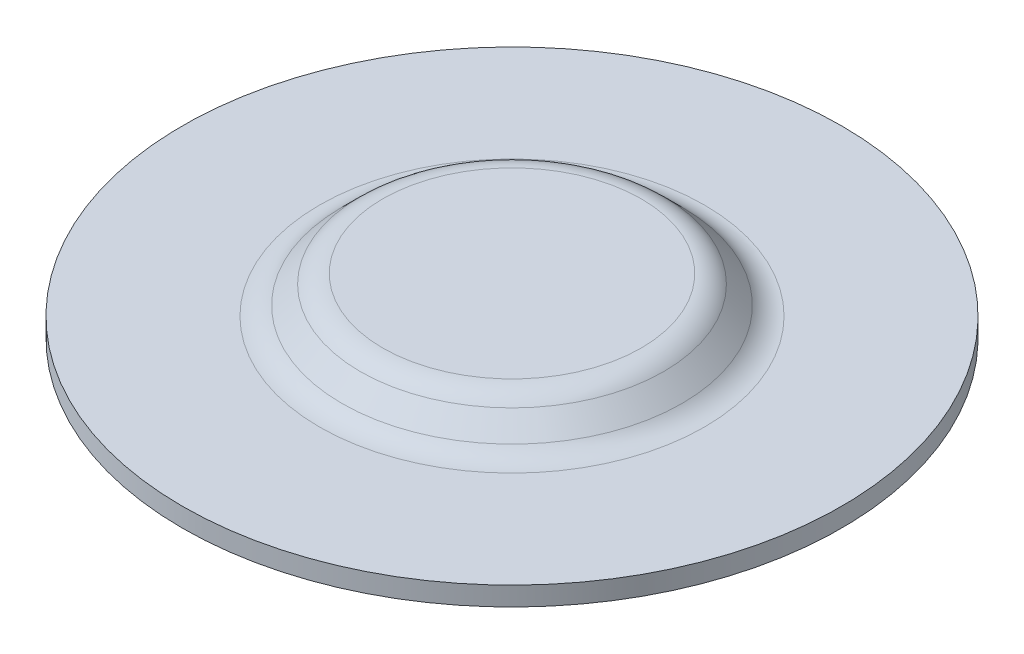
ISO-10303-21;
HEADER;
FILE_DESCRIPTION(('STEP AP214'),'2;1');
FILE_NAME('part.step','',(''),(''),'','','');
FILE_SCHEMA(('AUTOMOTIVE_DESIGN { 1 0 10303 214 1 1 1 1 }'));
ENDSEC;
DATA;
#1=APPLICATION_CONTEXT('core data for automotive mechanical design processes');
#2=APPLICATION_PROTOCOL_DEFINITION('international standard','automotive_design',2000,#1);
#3=PRODUCT_CONTEXT('',#1,'mechanical');
#4=PRODUCT('Part','Part','',(#3));
#5=PRODUCT_RELATED_PRODUCT_CATEGORY('part','',(#4));
#6=PRODUCT_DEFINITION_FORMATION('','',#4);
#7=PRODUCT_DEFINITION_CONTEXT('part definition',#1,'design');
#8=PRODUCT_DEFINITION('design','',#6,#7);
#9=PRODUCT_DEFINITION_SHAPE('','',#8);
#10=(LENGTH_UNIT() NAMED_UNIT(*) SI_UNIT(.MILLI.,.METRE.));
#11=(NAMED_UNIT(*) PLANE_ANGLE_UNIT() SI_UNIT($,.RADIAN.));
#12=(NAMED_UNIT(*) SI_UNIT($,.STERADIAN.) SOLID_ANGLE_UNIT());
#13=UNCERTAINTY_MEASURE_WITH_UNIT(LENGTH_MEASURE(1.E-05),#10,'distance_accuracy_value','');
#14=(GEOMETRIC_REPRESENTATION_CONTEXT(3) GLOBAL_UNCERTAINTY_ASSIGNED_CONTEXT((#13)) GLOBAL_UNIT_ASSIGNED_CONTEXT((#10,
#11,#12)) REPRESENTATION_CONTEXT('',''));
#15=CARTESIAN_POINT('',(0.,0.,0.));
#16=DIRECTION('',(0.,0.,1.));
#17=DIRECTION('',(1.,0.,0.));
#18=AXIS2_PLACEMENT_3D('',#15,#16,#17);
#19=CARTESIAN_POINT('',(0.,0.,0.));
#20=DIRECTION('',(0.,-1.,0.));
#21=DIRECTION('',(0.,0.,-1.));
#22=AXIS2_PLACEMENT_3D('',#19,#20,#21);
#23=PLANE('',#22);
#24=CARTESIAN_POINT('',(0.,0.,0.));
#25=DIRECTION('',(0.,-1.,0.));
#26=DIRECTION('',(0.,0.,1.));
#27=AXIS2_PLACEMENT_3D('',#24,#25,#26);
#28=CIRCLE('',#27,6.2267385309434);
#29=CARTESIAN_POINT('',(0.,0.,6.2267385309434));
#30=VERTEX_POINT('',#29);
#31=CARTESIAN_POINT('',(0.,0.,-6.2267385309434));
#32=VERTEX_POINT('',#31);
#33=EDGE_CURVE('E55',#30,#32,#28,.T.);
#34=ORIENTED_EDGE('',*,*,#33,.F.);
#35=CARTESIAN_POINT('',(0.,0.,0.));
#36=DIRECTION('',(0.,-1.,0.));
#37=DIRECTION('',(0.,0.,-1.));
#38=AXIS2_PLACEMENT_3D('',#35,#36,#37);
#39=CIRCLE('',#38,6.2267385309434);
#40=EDGE_CURVE('E57',#32,#30,#39,.T.);
#41=ORIENTED_EDGE('',*,*,#40,.F.);
#42=EDGE_LOOP('',(#34,#41));
#43=FACE_BOUND('',#42,.T.);
#44=ADVANCED_FACE('F18',(#43),#23,.F.);
#45=CARTESIAN_POINT('',(0.,-1.524,0.));
#46=DIRECTION('',(0.,1.,0.));
#47=DIRECTION('',(0.,0.,1.));
#48=AXIS2_PLACEMENT_3D('',#45,#46,#47);
#49=TOROIDAL_SURFACE('',#48,6.2267385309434,1.524);
#50=ORIENTED_EDGE('',*,*,#33,.T.);
#51=ORIENTED_EDGE('',*,*,#40,.T.);
#52=EDGE_LOOP('',(#50,#51));
#53=FACE_BOUND('',#52,.T.);
#54=CARTESIAN_POINT('',(0.,-0.446369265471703,0.));
#55=DIRECTION('',(0.,-1.,0.));
#56=DIRECTION('',(0.,0.,-1.));
#57=AXIS2_PLACEMENT_3D('',#54,#55,#56);
#58=CIRCLE('',#57,7.3043692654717);
#59=CARTESIAN_POINT('',(0.,-0.446369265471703,-7.3043692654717));
#60=VERTEX_POINT('',#59);
#61=EDGE_CURVE('E63',#60,#60,#58,.T.);
#62=ORIENTED_EDGE('',*,*,#61,.F.);
#63=EDGE_LOOP('',(#62));
#64=FACE_BOUND('',#63,.T.);
#65=ADVANCED_FACE('F59',(#53,#64),#49,.T.);
#66=CARTESIAN_POINT('',(0.,-1.3316307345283,0.));
#67=DIRECTION('',(0.,-1.,0.));
#68=DIRECTION('',(0.,0.,-1.));
#69=AXIS2_PLACEMENT_3D('',#66,#67,#68);
#70=CONICAL_SURFACE('',#69,8.18963073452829,0.785398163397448);
#71=CARTESIAN_POINT('',(0.,-1.3316307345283,0.));
#72=DIRECTION('',(0.,1.,0.));
#73=DIRECTION('',(0.,0.,1.));
#74=AXIS2_PLACEMENT_3D('',#71,#72,#73);
#75=CIRCLE('',#74,8.18963073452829);
#76=CARTESIAN_POINT('',(0.,-1.3316307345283,8.18963073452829));
#77=VERTEX_POINT('',#76);
#78=EDGE_CURVE('E221',#77,#77,#75,.T.);
#79=ORIENTED_EDGE('',*,*,#78,.T.);
#80=EDGE_LOOP('',(#79));
#81=FACE_BOUND('',#80,.T.);
#82=ORIENTED_EDGE('',*,*,#61,.T.);
#83=EDGE_LOOP('',(#82));
#84=FACE_BOUND('',#83,.T.);
#85=ADVANCED_FACE('F89',(#81,#84),#70,.T.);
#86=CARTESIAN_POINT('',(0.,-0.9144,0.));
#87=DIRECTION('',(0.,1.,0.));
#88=DIRECTION('',(0.,0.,1.));
#89=AXIS2_PLACEMENT_3D('',#86,#87,#88);
#90=PLANE('',#89);
#91=CARTESIAN_POINT('',(0.,-0.9144,0.));
#92=DIRECTION('',(0.,1.,0.));
#93=DIRECTION('',(0.,0.,-1.));
#94=AXIS2_PLACEMENT_3D('',#91,#92,#93);
#95=CIRCLE('',#94,6.2267385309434);
#96=CARTESIAN_POINT('',(0.,-0.9144,6.2267385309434));
#97=VERTEX_POINT('',#96);
#98=CARTESIAN_POINT('',(0.,-0.9144,-6.2267385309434));
#99=VERTEX_POINT('',#98);
#100=EDGE_CURVE('E217',#97,#99,#95,.F.);
#101=ORIENTED_EDGE('',*,*,#100,.T.);
#102=CARTESIAN_POINT('',(0.,-0.9144,0.));
#103=DIRECTION('',(0.,1.,0.));
#104=DIRECTION('',(0.,0.,1.));
#105=AXIS2_PLACEMENT_3D('',#102,#103,#104);
#106=CIRCLE('',#105,6.2267385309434);
#107=EDGE_CURVE('E215',#99,#97,#106,.F.);
#108=ORIENTED_EDGE('',*,*,#107,.T.);
#109=EDGE_LOOP('',(#101,#108));
#110=FACE_BOUND('',#109,.T.);
#111=ADVANCED_FACE('F191',(#110),#90,.F.);
#112=CARTESIAN_POINT('',(0.,-0.254,0.));
#113=DIRECTION('',(0.,1.,0.));
#114=DIRECTION('',(0.,0.,1.));
#115=AXIS2_PLACEMENT_3D('',#112,#113,#114);
#116=TOROIDAL_SURFACE('',#115,9.26726146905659,1.524);
#117=ORIENTED_EDGE('',*,*,#78,.F.);
#118=EDGE_LOOP('',(#117));
#119=FACE_BOUND('',#118,.T.);
#120=CARTESIAN_POINT('',(0.,-1.778,0.));
#121=DIRECTION('',(0.,1.,0.));
#122=DIRECTION('',(0.,0.,-1.));
#123=AXIS2_PLACEMENT_3D('',#120,#121,#122);
#124=CIRCLE('',#123,9.26726146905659);
#125=CARTESIAN_POINT('',(0.,-1.778,-9.26726146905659));
#126=VERTEX_POINT('',#125);
#127=CARTESIAN_POINT('',(0.,-1.778,9.26726146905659));
#128=VERTEX_POINT('',#127);
#129=EDGE_CURVE('E150',#126,#128,#124,.T.);
#130=ORIENTED_EDGE('',*,*,#129,.T.);
#131=CARTESIAN_POINT('',(0.,-1.778,0.));
#132=DIRECTION('',(0.,1.,0.));
#133=DIRECTION('',(0.,0.,1.));
#134=AXIS2_PLACEMENT_3D('',#131,#132,#133);
#135=CIRCLE('',#134,9.26726146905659);
#136=EDGE_CURVE('E182',#128,#126,#135,.T.);
#137=ORIENTED_EDGE('',*,*,#136,.T.);
#138=EDGE_LOOP('',(#130,#137));
#139=FACE_BOUND('',#138,.T.);
#140=ADVANCED_FACE('F188',(#119,#139),#116,.F.);
#141=CARTESIAN_POINT('',(0.,-1.524,0.));
#142=DIRECTION('',(0.,1.,0.));
#143=DIRECTION('',(0.,0.,1.));
#144=AXIS2_PLACEMENT_3D('',#141,#142,#143);
#145=TOROIDAL_SURFACE('',#144,6.2267385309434,0.6096);
#146=CARTESIAN_POINT('',(0.,-1.09294770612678,0.));
#147=DIRECTION('',(0.,-1.,0.));
#148=DIRECTION('',(0.,0.,-1.));
#149=AXIS2_PLACEMENT_3D('',#146,#147,#148);
#150=CIRCLE('',#149,6.65779082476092);
#151=CARTESIAN_POINT('',(0.,-1.09294770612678,-6.65779082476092));
#152=VERTEX_POINT('',#151);
#153=EDGE_CURVE('E107',#152,#152,#150,.T.);
#154=ORIENTED_EDGE('',*,*,#153,.T.);
#155=EDGE_LOOP('',(#154));
#156=FACE_BOUND('',#155,.T.);
#157=ORIENTED_EDGE('',*,*,#100,.F.);
#158=ORIENTED_EDGE('',*,*,#107,.F.);
#159=EDGE_LOOP('',(#157,#158));
#160=FACE_BOUND('',#159,.T.);
#161=ADVANCED_FACE('F167',(#156,#160),#145,.F.);
#162=CARTESIAN_POINT('',(9.26726146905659,-1.778,0.));
#163=DIRECTION('',(0.,-1.,0.));
#164=DIRECTION('',(0.,0.,-1.));
#165=AXIS2_PLACEMENT_3D('',#162,#163,#164);
#166=PLANE('',#165);
#167=CARTESIAN_POINT('',(0.,-1.778,0.));
#168=DIRECTION('',(0.,1.,0.));
#169=DIRECTION('',(0.,0.,1.));
#170=AXIS2_PLACEMENT_3D('',#167,#168,#169);
#171=CIRCLE('',#170,15.875);
#172=CARTESIAN_POINT('',(0.,-1.778,15.875));
#173=VERTEX_POINT('',#172);
#174=EDGE_CURVE('E104',#173,#173,#171,.F.);
#175=ORIENTED_EDGE('',*,*,#174,.F.);
#176=EDGE_LOOP('',(#175));
#177=FACE_BOUND('',#176,.T.);
#178=ORIENTED_EDGE('',*,*,#129,.F.);
#179=ORIENTED_EDGE('',*,*,#136,.F.);
#180=EDGE_LOOP('',(#178,#179));
#181=FACE_BOUND('',#180,.T.);
#182=ADVANCED_FACE('F157',(#177,#181),#166,.F.);
#183=CARTESIAN_POINT('',(0.,-1.97820917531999,0.));
#184=DIRECTION('',(0.,-1.,0.));
#185=DIRECTION('',(0.,0.,-1.));
#186=AXIS2_PLACEMENT_3D('',#183,#184,#185);
#187=CONICAL_SURFACE('',#186,7.54305229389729,0.785398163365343);
#188=ORIENTED_EDGE('',*,*,#153,.F.);
#189=EDGE_LOOP('',(#188));
#190=FACE_BOUND('',#189,.T.);
#191=CARTESIAN_POINT('',(0.,-1.97820917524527,0.));
#192=DIRECTION('',(0.,1.,0.));
#193=DIRECTION('',(0.,0.,1.));
#194=AXIS2_PLACEMENT_3D('',#191,#192,#193);
#195=CIRCLE('',#194,7.54305229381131);
#196=CARTESIAN_POINT('',(0.,-1.97820917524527,7.54305229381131));
#197=VERTEX_POINT('',#196);
#198=EDGE_CURVE('E103',#197,#197,#195,.T.);
#199=ORIENTED_EDGE('',*,*,#198,.F.);
#200=EDGE_LOOP('',(#199));
#201=FACE_BOUND('',#200,.T.);
#202=ADVANCED_FACE('F166',(#190,#201),#187,.F.);
#203=CARTESIAN_POINT('',(0.,0.,0.));
#204=DIRECTION('',(0.,1.,0.));
#205=DIRECTION('',(0.,0.,1.));
#206=AXIS2_PLACEMENT_3D('',#203,#204,#205);
#207=CYLINDRICAL_SURFACE('',#206,15.875);
#208=ORIENTED_EDGE('',*,*,#174,.T.);
#209=EDGE_LOOP('',(#208));
#210=FACE_BOUND('',#209,.T.);
#211=CARTESIAN_POINT('',(0.,-2.6924,0.));
#212=DIRECTION('',(0.,1.,0.));
#213=DIRECTION('',(0.,0.,1.));
#214=AXIS2_PLACEMENT_3D('',#211,#212,#213);
#215=CIRCLE('',#214,15.875);
#216=CARTESIAN_POINT('',(0.,-2.6924,15.875));
#217=VERTEX_POINT('',#216);
#218=EDGE_CURVE('E95',#217,#217,#215,.T.);
#219=ORIENTED_EDGE('',*,*,#218,.T.);
#220=EDGE_LOOP('',(#219));
#221=FACE_BOUND('',#220,.T.);
#222=ADVANCED_FACE('F127',(#210,#221),#207,.T.);
#223=CARTESIAN_POINT('',(0.,-0.254,0.));
#224=DIRECTION('',(0.,1.,0.));
#225=DIRECTION('',(0.,0.,1.));
#226=AXIS2_PLACEMENT_3D('',#223,#224,#225);
#227=TOROIDAL_SURFACE('',#226,9.26726146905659,2.4384);
#228=CARTESIAN_POINT('',(0.,-2.6924,0.));
#229=DIRECTION('',(0.,-1.,0.));
#230=DIRECTION('',(0.,0.,1.));
#231=AXIS2_PLACEMENT_3D('',#228,#229,#230);
#232=CIRCLE('',#231,9.26726146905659);
#233=CARTESIAN_POINT('',(0.,-2.6924,9.26726146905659));
#234=VERTEX_POINT('',#233);
#235=CARTESIAN_POINT('',(0.,-2.6924,-9.26726146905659));
#236=VERTEX_POINT('',#235);
#237=EDGE_CURVE('E29',#234,#236,#232,.T.);
#238=ORIENTED_EDGE('',*,*,#237,.T.);
#239=CARTESIAN_POINT('',(0.,-2.6924,0.));
#240=DIRECTION('',(0.,-1.,0.));
#241=DIRECTION('',(0.,0.,-1.));
#242=AXIS2_PLACEMENT_3D('',#239,#240,#241);
#243=CIRCLE('',#242,9.26726146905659);
#244=EDGE_CURVE('E11',#236,#234,#243,.T.);
#245=ORIENTED_EDGE('',*,*,#244,.T.);
#246=EDGE_LOOP('',(#238,#245));
#247=FACE_BOUND('',#246,.T.);
#248=ORIENTED_EDGE('',*,*,#198,.T.);
#249=EDGE_LOOP('',(#248));
#250=FACE_BOUND('',#249,.T.);
#251=ADVANCED_FACE('F115',(#247,#250),#227,.T.);
#252=CARTESIAN_POINT('',(9.26726146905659,-2.6924,0.));
#253=DIRECTION('',(0.,1.,0.));
#254=DIRECTION('',(0.,0.,1.));
#255=AXIS2_PLACEMENT_3D('',#252,#253,#254);
#256=PLANE('',#255);
#257=ORIENTED_EDGE('',*,*,#237,.F.);
#258=ORIENTED_EDGE('',*,*,#244,.F.);
#259=EDGE_LOOP('',(#257,#258));
#260=FACE_BOUND('',#259,.T.);
#261=ORIENTED_EDGE('',*,*,#218,.F.);
#262=EDGE_LOOP('',(#261));
#263=FACE_BOUND('',#262,.T.);
#264=ADVANCED_FACE('F126',(#260,#263),#256,.F.);
#265=CLOSED_SHELL('',(#44,#65,#85,#111,#140,#161,#182,#202,#222,#251,#264));
#266=MANIFOLD_SOLID_BREP('B1',#265);
#267=ADVANCED_BREP_SHAPE_REPRESENTATION('',(#18,#266),#14);
#268=SHAPE_DEFINITION_REPRESENTATION(#9,#267);
ENDSEC;
END-ISO-10303-21;
